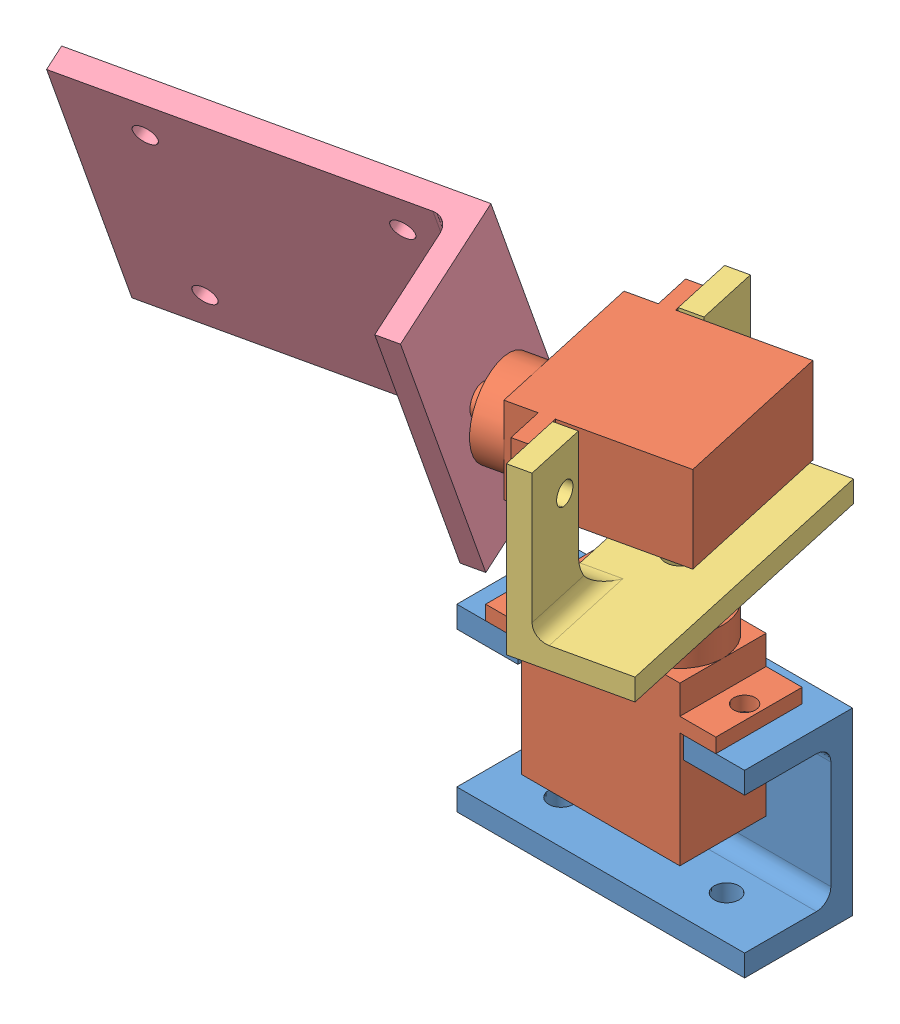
SolidWorks assembly Assembly.SLDASM, configuration Défaut (file format 9000). Lengths in mm.
Overall size (86.04 77.01 55.61).
5 component instances, 4 part files, 6 mates.
Components (placement in the parent):
- Yaw-1: Yaw.SLDPRT [Défaut] at (-13.025 -14.4788 32.5) size (40 25 15)
- Servo9g-1: Servo9g.SLDPRT [Défaut] at (-5.3198 -17.9048 43.8238) x (1 0 0) z (0 1 0) size (32 12 28.5)
- Pitch-1: Pitch.SLDPRT [Défaut] at (-4.1845 10.5952 20.3482) x (-0.217292 0 -0.976107) z (0 1 0) size (40 15 23)
- Servo9g-2: Servo9g.SLDPRT [Défaut] at (2.6237 25.2714 46.3293) x (0.217292 0 0.976107) z (-0.976107 0 0.217292) size (32 12 28.5)
- Lidar holder-1: Lidar holder.SLDPRT [Défaut] at (-55.3946 33.596 48.2836) x (0.976107 0 -0.217292) z (-0.084905 -0.9205 -0.381407) size (50 18 40)
Mates (geometry in assembly coordinates):
- Coïncidente1: coincident anti-aligned: circle of Yaw-1; circle of Servo9g-1
- Coïncidente2: coincident anti-aligned: circle of Yaw-1; circle of Servo9g-1
- Coïncidente4: coincident aligned: circle of Servo9g-1; circle of Pitch-1
- Coïncidente5: coincident anti-aligned: circle of Pitch-1; circle of Servo9g-2
- Coïncidente6: coincident anti-aligned: circle of Pitch-1; circle of Servo9g-2
- Coïncidente7: coincident anti-aligned: circle of Servo9g-2; circle of Lidar holder-1
